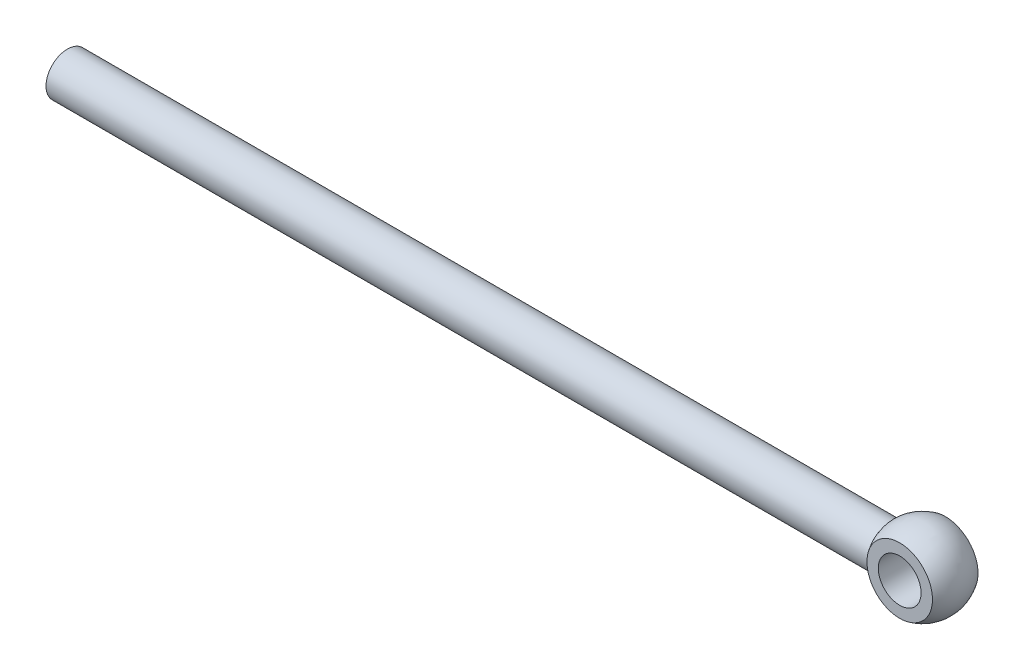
ISO-10303-21;
HEADER;
FILE_DESCRIPTION(('STEP AP214'),'2;1');
FILE_NAME('part.step','',(''),(''),'','','');
FILE_SCHEMA(('AUTOMOTIVE_DESIGN { 1 0 10303 214 1 1 1 1 }'));
ENDSEC;
DATA;
#1=APPLICATION_CONTEXT('core data for automotive mechanical design processes');
#2=APPLICATION_PROTOCOL_DEFINITION('international standard','automotive_design',2000,#1);
#3=PRODUCT_CONTEXT('',#1,'mechanical');
#4=PRODUCT('Part','Part','',(#3));
#5=PRODUCT_RELATED_PRODUCT_CATEGORY('part','',(#4));
#6=PRODUCT_DEFINITION_FORMATION('','',#4);
#7=PRODUCT_DEFINITION_CONTEXT('part definition',#1,'design');
#8=PRODUCT_DEFINITION('design','',#6,#7);
#9=PRODUCT_DEFINITION_SHAPE('','',#8);
#10=(LENGTH_UNIT() NAMED_UNIT(*) SI_UNIT(.MILLI.,.METRE.));
#11=(NAMED_UNIT(*) PLANE_ANGLE_UNIT() SI_UNIT($,.RADIAN.));
#12=(NAMED_UNIT(*) SI_UNIT($,.STERADIAN.) SOLID_ANGLE_UNIT());
#13=UNCERTAINTY_MEASURE_WITH_UNIT(LENGTH_MEASURE(1.E-05),#10,'distance_accuracy_value','');
#14=(GEOMETRIC_REPRESENTATION_CONTEXT(3) GLOBAL_UNCERTAINTY_ASSIGNED_CONTEXT((#13)) GLOBAL_UNIT_ASSIGNED_CONTEXT((#10,
#11,#12)) REPRESENTATION_CONTEXT('',''));
#15=CARTESIAN_POINT('',(0.,0.,0.));
#16=DIRECTION('',(0.,0.,1.));
#17=DIRECTION('',(1.,0.,0.));
#18=AXIS2_PLACEMENT_3D('',#15,#16,#17);
#19=CARTESIAN_POINT('',(1500.,0.,0.));
#20=DIRECTION('',(-1.,0.,0.));
#21=DIRECTION('',(0.,1.,0.));
#22=AXIS2_PLACEMENT_3D('',#19,#20,#21);
#23=SPHERICAL_SURFACE('',#22,70.0000000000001);
#24=CARTESIAN_POINT('',(1500.,0.,-40.));
#25=DIRECTION('',(0.,0.,-1.));
#26=DIRECTION('',(-1.,0.,0.));
#27=AXIS2_PLACEMENT_3D('',#24,#25,#26);
#28=CIRCLE('',#27,57.4456264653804);
#29=CARTESIAN_POINT('',(1442.55437353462,0.,-40.));
#30=VERTEX_POINT('',#29);
#31=EDGE_CURVE('E38',#30,#30,#28,.T.);
#32=ORIENTED_EDGE('',*,*,#31,.F.);
#33=EDGE_LOOP('',(#32));
#34=FACE_BOUND('',#33,.T.);
#35=CARTESIAN_POINT('',(1440.89204791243,0.,0.));
#36=DIRECTION('',(1.,0.,0.));
#37=DIRECTION('',(0.,0.,-1.));
#38=AXIS2_PLACEMENT_3D('',#35,#36,#37);
#39=CIRCLE('',#38,37.5);
#40=CARTESIAN_POINT('',(1440.89204791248,0.,37.5));
#41=VERTEX_POINT('',#40);
#42=EDGE_CURVE('E76',#41,#41,#39,.F.);
#43=ORIENTED_EDGE('',*,*,#42,.F.);
#44=EDGE_LOOP('',(#43));
#45=FACE_BOUND('',#44,.T.);
#46=CARTESIAN_POINT('',(1570.,0.,0.));
#47=VERTEX_POINT('',#46);
#48=VERTEX_LOOP('',#47);
#49=FACE_BOUND('',#48,.T.);
#50=CARTESIAN_POINT('',(1500.,0.,40.));
#51=DIRECTION('',(0.,0.,1.));
#52=DIRECTION('',(1.,0.,0.));
#53=AXIS2_PLACEMENT_3D('',#50,#51,#52);
#54=CIRCLE('',#53,57.4456264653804);
#55=CARTESIAN_POINT('',(1557.44562646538,0.,40.));
#56=VERTEX_POINT('',#55);
#57=EDGE_CURVE('E11',#56,#56,#54,.T.);
#58=ORIENTED_EDGE('',*,*,#57,.F.);
#59=EDGE_LOOP('',(#58));
#60=FACE_BOUND('',#59,.T.);
#61=ADVANCED_FACE('F32',(#34,#45,#49,#60),#23,.T.);
#62=CARTESIAN_POINT('',(500000.,0.,0.));
#63=DIRECTION('',(-1.,0.,0.));
#64=DIRECTION('',(0.,0.,1.));
#65=AXIS2_PLACEMENT_3D('',#62,#63,#64);
#66=CYLINDRICAL_SURFACE('',#65,37.5);
#67=CARTESIAN_POINT('',(0.,0.,0.));
#68=DIRECTION('',(1.,0.,0.));
#69=DIRECTION('',(0.,0.,-1.));
#70=AXIS2_PLACEMENT_3D('',#67,#68,#69);
#71=CIRCLE('',#70,37.5);
#72=CARTESIAN_POINT('',(0.,0.,37.5));
#73=VERTEX_POINT('',#72);
#74=EDGE_CURVE('E73',#73,#73,#71,.T.);
#75=CARTESIAN_POINT('',(0.,0.,37.5));
#76=CARTESIAN_POINT('',(15.0092921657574,0.,37.5));
#77=CARTESIAN_POINT('',(30.0185843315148,0.,37.5));
#78=CARTESIAN_POINT('',(60.0371686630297,0.,37.5));
#79=CARTESIAN_POINT('',(75.0464608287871,0.,37.5));
#80=CARTESIAN_POINT('',(105.065045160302,0.,37.5));
#81=CARTESIAN_POINT('',(120.074337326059,0.,37.5));
#82=CARTESIAN_POINT('',(150.092921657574,0.,37.5));
#83=CARTESIAN_POINT('',(165.102213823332,0.,37.5));
#84=CARTESIAN_POINT('',(195.120798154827,0.,37.5));
#85=CARTESIAN_POINT('',(210.130090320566,0.,37.5));
#86=CARTESIAN_POINT('',(240.148674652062,0.,37.5));
#87=CARTESIAN_POINT('',(255.157966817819,0.,37.5));
#88=CARTESIAN_POINT('',(285.176551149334,0.,37.5));
#89=CARTESIAN_POINT('',(300.185843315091,0.,37.5));
#90=CARTESIAN_POINT('',(330.204427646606,0.,37.5));
#91=CARTESIAN_POINT('',(345.213719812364,0.,37.5));
#92=CARTESIAN_POINT('',(375.232304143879,0.,37.5));
#93=CARTESIAN_POINT('',(390.241596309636,0.,37.5));
#94=CARTESIAN_POINT('',(420.260180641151,0.,37.5));
#95=CARTESIAN_POINT('',(435.269472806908,0.,37.5));
#96=CARTESIAN_POINT('',(465.288057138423,0.,37.5));
#97=CARTESIAN_POINT('',(480.29734930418,0.,37.5));
#98=CARTESIAN_POINT('',(510.315933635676,0.,37.5));
#99=CARTESIAN_POINT('',(525.325225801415,0.,37.5));
#100=CARTESIAN_POINT('',(555.343810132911,0.,37.5));
#101=CARTESIAN_POINT('',(570.353102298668,0.,37.5));
#102=CARTESIAN_POINT('',(600.371686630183,0.,37.5));
#103=CARTESIAN_POINT('',(615.38097879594,0.,37.5));
#104=CARTESIAN_POINT('',(645.399563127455,0.,37.5));
#105=CARTESIAN_POINT('',(660.408855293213,0.,37.5));
#106=CARTESIAN_POINT('',(690.427439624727,0.,37.5));
#107=CARTESIAN_POINT('',(705.436731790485,0.,37.5));
#108=CARTESIAN_POINT('',(735.455316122,0.,37.5));
#109=CARTESIAN_POINT('',(750.464608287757,0.,37.5));
#110=CARTESIAN_POINT('',(780.483192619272,0.,37.5));
#111=CARTESIAN_POINT('',(795.492484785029,0.,37.5));
#112=CARTESIAN_POINT('',(825.511069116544,0.,37.5));
#113=CARTESIAN_POINT('',(840.520361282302,0.,37.5));
#114=CARTESIAN_POINT('',(870.538945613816,0.,37.5));
#115=CARTESIAN_POINT('',(885.548237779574,0.,37.5));
#116=CARTESIAN_POINT('',(915.56682211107,0.,37.5));
#117=CARTESIAN_POINT('',(930.576114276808,0.,37.5));
#118=CARTESIAN_POINT('',(960.594698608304,0.,37.5));
#119=CARTESIAN_POINT('',(975.603990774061,0.,37.5));
#120=CARTESIAN_POINT('',(1005.62257510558,0.,37.5));
#121=CARTESIAN_POINT('',(1020.63186727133,0.,37.5));
#122=CARTESIAN_POINT('',(1050.65045160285,0.,37.5));
#123=CARTESIAN_POINT('',(1065.65974376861,0.,37.5));
#124=CARTESIAN_POINT('',(1095.67832810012,0.,37.5));
#125=CARTESIAN_POINT('',(1110.68762026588,0.,37.5));
#126=CARTESIAN_POINT('',(1140.70620459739,0.,37.5));
#127=CARTESIAN_POINT('',(1155.71549676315,0.,37.5));
#128=CARTESIAN_POINT('',(1185.73408109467,0.,37.5));
#129=CARTESIAN_POINT('',(1200.74337326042,0.,37.5));
#130=CARTESIAN_POINT('',(1230.76195759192,0.,37.5));
#131=CARTESIAN_POINT('',(1245.77124975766,0.,37.5));
#132=CARTESIAN_POINT('',(1275.78983408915,0.,37.5));
#133=CARTESIAN_POINT('',(1290.79912625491,0.,37.5));
#134=CARTESIAN_POINT('',(1320.81771058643,0.,37.5));
#135=CARTESIAN_POINT('',(1335.82700275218,0.,37.5));
#136=CARTESIAN_POINT('',(1365.8455870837,0.,37.5));
#137=CARTESIAN_POINT('',(1380.85487924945,0.,37.5));
#138=CARTESIAN_POINT('',(1410.87346358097,0.,37.5));
#139=CARTESIAN_POINT('',(1425.88275574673,0.,37.5));
#140=CARTESIAN_POINT('',(1440.89204791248,0.,37.5));
#141=B_SPLINE_CURVE_WITH_KNOTS('',3,(#75,#76,#77,#78,#79,#80,#81,#82,#83,#84,#85,#86,#87,#88,
#89,#90,#91,#92,#93,#94,#95,#96,#97,#98,#99,#100,#101,#102,#103,#104,#105,#106,#107,#108,#109,
#110,#111,#112,#113,#114,#115,#116,#117,#118,#119,#120,#121,#122,#123,#124,#125,#126,#127,#128,
#129,#130,#131,#132,#133,#134,#135,#136,#137,#138,#139,#140),.UNSPECIFIED.,.F.,.F.,(4,2,2,2,2,2,
2,2,2,2,2,2,2,2,2,2,2,2,2,2,2,2,2,2,2,2,2,2,2,2,2,2,4),(0.,45.0278764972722,90.0557529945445,
135.083629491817,180.111505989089,225.139382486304,270.167258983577,315.195135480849,
360.223011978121,405.250888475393,450.278764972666,495.306641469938,540.334517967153,
585.362394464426,630.390270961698,675.41814745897,720.446023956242,765.473900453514,
810.501776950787,855.529653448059,900.557529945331,945.585406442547,990.613282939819,
1035.64115943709,1080.66903593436,1125.69691243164,1170.72478892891,1215.75266542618,
1260.7805419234,1305.80841842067,1350.83629491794,1395.86417141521,1440.89204791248),.UNSPECIFIED.);
#142=EDGE_CURVE('BSEAM43',#73,#41,#141,.T.);
#143=ORIENTED_EDGE('',*,*,#74,.T.);
#144=ORIENTED_EDGE('',*,*,#42,.T.);
#145=ORIENTED_EDGE('',*,*,#142,.T.);
#146=ORIENTED_EDGE('',*,*,#142,.F.);
#147=EDGE_LOOP('',(#143,#145,#144,#146));
#148=FACE_BOUND('',#147,.T.);
#149=ADVANCED_FACE('F43',(#148),#66,.T.);
#150=CARTESIAN_POINT('',(0.,0.,0.));
#151=DIRECTION('',(1.,0.,0.));
#152=DIRECTION('',(0.,0.,-1.));
#153=AXIS2_PLACEMENT_3D('',#150,#151,#152);
#154=PLANE('',#153);
#155=ORIENTED_EDGE('',*,*,#74,.F.);
#156=EDGE_LOOP('',(#155));
#157=FACE_BOUND('',#156,.T.);
#158=ADVANCED_FACE('F45',(#157),#154,.F.);
#159=CARTESIAN_POINT('',(1430.,1978.04354097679,-40.));
#160=DIRECTION('',(0.,0.,-1.));
#161=DIRECTION('',(-1.,0.,0.));
#162=AXIS2_PLACEMENT_3D('',#159,#160,#161);
#163=PLANE('',#162);
#164=CARTESIAN_POINT('',(1500.,0.,-40.));
#165=DIRECTION('',(0.,0.,-1.));
#166=DIRECTION('',(-1.,0.,0.));
#167=AXIS2_PLACEMENT_3D('',#164,#165,#166);
#168=CIRCLE('',#167,37.5);
#169=CARTESIAN_POINT('',(1537.5,0.,-40.));
#170=VERTEX_POINT('',#169);
#171=EDGE_CURVE('E80',#170,#170,#168,.T.);
#172=ORIENTED_EDGE('',*,*,#171,.F.);
#173=EDGE_LOOP('',(#172));
#174=FACE_BOUND('',#173,.T.);
#175=ORIENTED_EDGE('',*,*,#31,.T.);
#176=EDGE_LOOP('',(#175));
#177=FACE_BOUND('',#176,.T.);
#178=ADVANCED_FACE('F51',(#174,#177),#163,.T.);
#179=CARTESIAN_POINT('',(1430.,1978.04354097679,40.));
#180=DIRECTION('',(0.,0.,1.));
#181=DIRECTION('',(1.,0.,0.));
#182=AXIS2_PLACEMENT_3D('',#179,#180,#181);
#183=PLANE('',#182);
#184=CARTESIAN_POINT('',(1500.,0.,40.));
#185=DIRECTION('',(0.,0.,1.));
#186=DIRECTION('',(1.,0.,0.));
#187=AXIS2_PLACEMENT_3D('',#184,#185,#186);
#188=CIRCLE('',#187,37.5);
#189=CARTESIAN_POINT('',(1537.5,0.,40.));
#190=VERTEX_POINT('',#189);
#191=EDGE_CURVE('E85',#190,#190,#188,.T.);
#192=ORIENTED_EDGE('',*,*,#191,.F.);
#193=EDGE_LOOP('',(#192));
#194=FACE_BOUND('',#193,.T.);
#195=ORIENTED_EDGE('',*,*,#57,.T.);
#196=EDGE_LOOP('',(#195));
#197=FACE_BOUND('',#196,.T.);
#198=ADVANCED_FACE('F48',(#194,#197),#183,.T.);
#199=CARTESIAN_POINT('',(1500.,0.,-70.0000000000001));
#200=DIRECTION('',(0.,0.,1.));
#201=DIRECTION('',(1.,0.,0.));
#202=AXIS2_PLACEMENT_3D('',#199,#200,#201);
#203=CYLINDRICAL_SURFACE('',#202,37.5);
#204=CARTESIAN_POINT('',(1537.5,0.,-40.));
#205=CARTESIAN_POINT('',(1537.5,0.,-39.1666666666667));
#206=CARTESIAN_POINT('',(1537.5,0.,-38.3333333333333));
#207=CARTESIAN_POINT('',(1537.5,0.,-36.6666666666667));
#208=CARTESIAN_POINT('',(1537.5,0.,-35.8333333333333));
#209=CARTESIAN_POINT('',(1537.5,0.,-34.1666666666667));
#210=CARTESIAN_POINT('',(1537.5,0.,-33.3333333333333));
#211=CARTESIAN_POINT('',(1537.5,0.,-31.6666666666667));
#212=CARTESIAN_POINT('',(1537.5,0.,-30.8333333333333));
#213=CARTESIAN_POINT('',(1537.5,0.,-29.1666666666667));
#214=CARTESIAN_POINT('',(1537.5,0.,-28.3333333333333));
#215=CARTESIAN_POINT('',(1537.5,0.,-26.6666666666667));
#216=CARTESIAN_POINT('',(1537.5,0.,-25.8333333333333));
#217=CARTESIAN_POINT('',(1537.5,0.,-24.1666666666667));
#218=CARTESIAN_POINT('',(1537.5,0.,-23.3333333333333));
#219=CARTESIAN_POINT('',(1537.5,0.,-21.6666666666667));
#220=CARTESIAN_POINT('',(1537.5,0.,-20.8333333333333));
#221=CARTESIAN_POINT('',(1537.5,0.,-19.1666666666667));
#222=CARTESIAN_POINT('',(1537.5,0.,-18.3333333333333));
#223=CARTESIAN_POINT('',(1537.5,0.,-16.6666666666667));
#224=CARTESIAN_POINT('',(1537.5,0.,-15.8333333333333));
#225=CARTESIAN_POINT('',(1537.5,0.,-14.1666666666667));
#226=CARTESIAN_POINT('',(1537.5,0.,-13.3333333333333));
#227=CARTESIAN_POINT('',(1537.5,0.,-11.6666666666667));
#228=CARTESIAN_POINT('',(1537.5,0.,-10.8333333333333));
#229=CARTESIAN_POINT('',(1537.5,0.,-9.16666666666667));
#230=CARTESIAN_POINT('',(1537.5,0.,-8.33333333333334));
#231=CARTESIAN_POINT('',(1537.5,0.,-6.66666666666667));
#232=CARTESIAN_POINT('',(1537.5,0.,-5.83333333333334));
#233=CARTESIAN_POINT('',(1537.5,0.,-4.16666666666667));
#234=CARTESIAN_POINT('',(1537.5,0.,-3.33333333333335));
#235=CARTESIAN_POINT('',(1537.5,0.,-1.66666666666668));
#236=CARTESIAN_POINT('',(1537.5,0.,-0.833333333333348));
#237=CARTESIAN_POINT('',(1537.5,0.,0.83333333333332));
#238=CARTESIAN_POINT('',(1537.5,0.,1.66666666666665));
#239=CARTESIAN_POINT('',(1537.5,0.,3.33333333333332));
#240=CARTESIAN_POINT('',(1537.5,0.,4.16666666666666));
#241=CARTESIAN_POINT('',(1537.5,0.,5.83333333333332));
#242=CARTESIAN_POINT('',(1537.5,0.,6.66666666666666));
#243=CARTESIAN_POINT('',(1537.5,0.,8.33333333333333));
#244=CARTESIAN_POINT('',(1537.5,0.,9.16666666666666));
#245=CARTESIAN_POINT('',(1537.5,0.,10.8333333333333));
#246=CARTESIAN_POINT('',(1537.5,0.,11.6666666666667));
#247=CARTESIAN_POINT('',(1537.5,0.,13.3333333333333));
#248=CARTESIAN_POINT('',(1537.5,0.,14.1666666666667));
#249=CARTESIAN_POINT('',(1537.5,0.,15.8333333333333));
#250=CARTESIAN_POINT('',(1537.5,0.,16.6666666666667));
#251=CARTESIAN_POINT('',(1537.5,0.,18.3333333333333));
#252=CARTESIAN_POINT('',(1537.5,0.,19.1666666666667));
#253=CARTESIAN_POINT('',(1537.5,0.,20.8333333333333));
#254=CARTESIAN_POINT('',(1537.5,0.,21.6666666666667));
#255=CARTESIAN_POINT('',(1537.5,0.,23.3333333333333));
#256=CARTESIAN_POINT('',(1537.5,0.,24.1666666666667));
#257=CARTESIAN_POINT('',(1537.5,0.,25.8333333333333));
#258=CARTESIAN_POINT('',(1537.5,0.,26.6666666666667));
#259=CARTESIAN_POINT('',(1537.5,0.,28.3333333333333));
#260=CARTESIAN_POINT('',(1537.5,0.,29.1666666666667));
#261=CARTESIAN_POINT('',(1537.5,0.,30.8333333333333));
#262=CARTESIAN_POINT('',(1537.5,0.,31.6666666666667));
#263=CARTESIAN_POINT('',(1537.5,0.,33.3333333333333));
#264=CARTESIAN_POINT('',(1537.5,0.,34.1666666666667));
#265=CARTESIAN_POINT('',(1537.5,0.,35.8333333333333));
#266=CARTESIAN_POINT('',(1537.5,0.,36.6666666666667));
#267=CARTESIAN_POINT('',(1537.5,0.,38.3333333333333));
#268=CARTESIAN_POINT('',(1537.5,0.,39.1666666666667));
#269=CARTESIAN_POINT('',(1537.5,0.,40.));
#270=B_SPLINE_CURVE_WITH_KNOTS('',3,(#204,#205,#206,#207,#208,#209,#210,#211,#212,#213,#214,
#215,#216,#217,#218,#219,#220,#221,#222,#223,#224,#225,#226,#227,#228,#229,#230,#231,#232,#233,
#234,#235,#236,#237,#238,#239,#240,#241,#242,#243,#244,#245,#246,#247,#248,#249,#250,#251,#252,
#253,#254,#255,#256,#257,#258,#259,#260,#261,#262,#263,#264,#265,#266,#267,#268,#269),
.UNSPECIFIED.,.F.,.F.,(4,2,2,2,2,2,2,2,2,2,2,2,2,2,2,2,2,2,2,2,2,2,2,2,2,2,2,2,2,2,2,2,4),(0.,
2.5,4.99999999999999,7.49999999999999,9.99999999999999,12.5,15.,17.5,20.,22.5,25.,27.5,30.,32.5,
35.,37.5,40.,42.5,45.,47.5,50.,52.5,55.,57.5,60.,62.5,65.,67.5,70.,72.5,75.,77.5,80.),.UNSPECIFIED.);
#271=EDGE_CURVE('BSEAM50',#170,#190,#270,.T.);
#272=ORIENTED_EDGE('',*,*,#171,.T.);
#273=ORIENTED_EDGE('',*,*,#191,.T.);
#274=ORIENTED_EDGE('',*,*,#271,.T.);
#275=ORIENTED_EDGE('',*,*,#271,.F.);
#276=EDGE_LOOP('',(#272,#274,#273,#275));
#277=FACE_BOUND('',#276,.T.);
#278=ADVANCED_FACE('F50',(#277),#203,.F.);
#279=CLOSED_SHELL('',(#61,#149,#158,#178,#198,#278));
#280=MANIFOLD_SOLID_BREP('B2',#279);
#281=ADVANCED_BREP_SHAPE_REPRESENTATION('',(#18,#280),#14);
#282=SHAPE_DEFINITION_REPRESENTATION(#9,#281);
ENDSEC;
END-ISO-10303-21;
